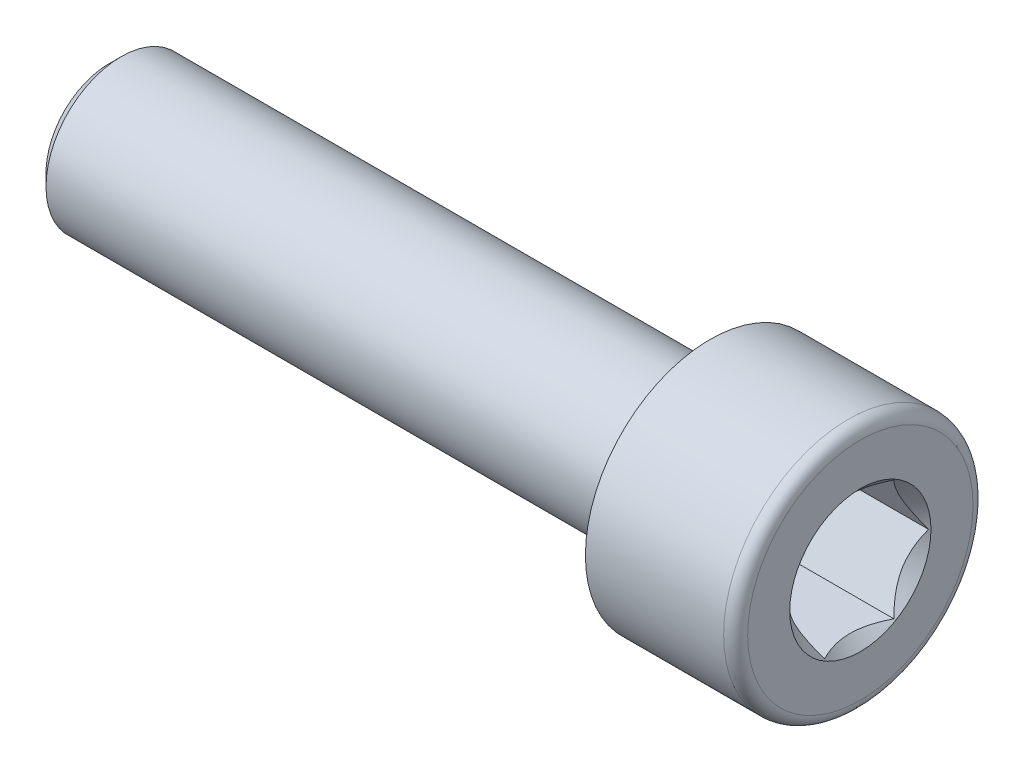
from build123d import *

# Parameters (mm, degrees)
CHANFREIN1_SIZE         = 0.4
ENL_V_MAT_EXTRU_1_DEPTH = 3.5


with BuildPart() as part:
    # Esquisse1 → Base-R_volution (revolve)
    with BuildSketch(Plane.XY, mode=Mode.PRIVATE) as base_r_volution_sk:
        with BuildLine():
            Line((0, 2.5), (0, 4.15))
            Line((0, 4.15), (4.6, 4.15))
            ThreePointArc((4.6, 4.15), (4.882842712, 4.032842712), (5, 3.75))
            Line((5, 3.75), (5, 2.35))
            Line((5, 2.35), (4.65, 2))
            Line((4.65, 2), (1.6, 2))
            Line((1.6, 2), (0.445299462, 0))
            Line((0.445299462, 0), (-20, 0))
            Line((-20, 0), (-20, 2.5))
            Line((-20, 2.5), (0, 2.5))
        make_face()
    revolve(base_r_volution_sk.sketch.rotate(Axis((-30, 0, 0), (1, 0, 0)), 90), axis=Axis((-30, 0, 0), (1, 0, 0)))

    # Chanfrein1
    chanfrein1_edges = [part.edges().sort_by_distance(p)[0] for p in [
        (-20, 0, -2.5),
    ]]
    chamfer(chanfrein1_edges, length=CHANFREIN1_SIZE)

    # Esquisse2 → Enl_v. mat.-Extru.1 (cut)
    with BuildSketch(Plane(origin=(5, 0, 0), x_dir=(0, 0, -1), z_dir=(1, 0, 0))):
        Polygon((-2.309401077, 0), (-1.154700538, -2), (1.154700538, -2), (2.309401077, 0), (1.154700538, 2), (-1.154700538, 2), align=None)
    extrude(amount=-ENL_V_MAT_EXTRU_1_DEPTH, mode=Mode.SUBTRACT)


solid = part.part
